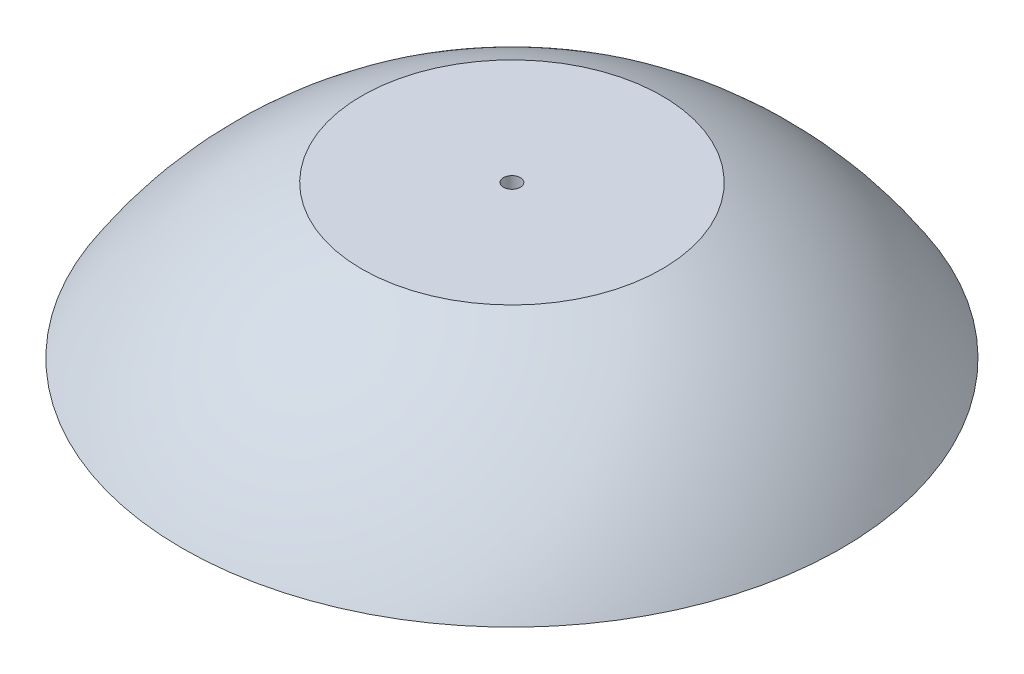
ISO-10303-21;
HEADER;
FILE_DESCRIPTION(('STEP AP214'),'2;1');
FILE_NAME('part.step','',(''),(''),'','','');
FILE_SCHEMA(('AUTOMOTIVE_DESIGN { 1 0 10303 214 1 1 1 1 }'));
ENDSEC;
DATA;
#1=APPLICATION_CONTEXT('core data for automotive mechanical design processes');
#2=APPLICATION_PROTOCOL_DEFINITION('international standard','automotive_design',2000,#1);
#3=PRODUCT_CONTEXT('',#1,'mechanical');
#4=PRODUCT('Part','Part','',(#3));
#5=PRODUCT_RELATED_PRODUCT_CATEGORY('part','',(#4));
#6=PRODUCT_DEFINITION_FORMATION('','',#4);
#7=PRODUCT_DEFINITION_CONTEXT('part definition',#1,'design');
#8=PRODUCT_DEFINITION('design','',#6,#7);
#9=PRODUCT_DEFINITION_SHAPE('','',#8);
#10=(LENGTH_UNIT() NAMED_UNIT(*) SI_UNIT(.MILLI.,.METRE.));
#11=(NAMED_UNIT(*) PLANE_ANGLE_UNIT() SI_UNIT($,.RADIAN.));
#12=(NAMED_UNIT(*) SI_UNIT($,.STERADIAN.) SOLID_ANGLE_UNIT());
#13=UNCERTAINTY_MEASURE_WITH_UNIT(LENGTH_MEASURE(1.E-05),#10,'distance_accuracy_value','');
#14=(GEOMETRIC_REPRESENTATION_CONTEXT(3) GLOBAL_UNCERTAINTY_ASSIGNED_CONTEXT((#13)) GLOBAL_UNIT_ASSIGNED_CONTEXT((#10,
#11,#12)) REPRESENTATION_CONTEXT('',''));
#15=CARTESIAN_POINT('',(0.,0.,0.));
#16=DIRECTION('',(0.,0.,1.));
#17=DIRECTION('',(1.,0.,0.));
#18=AXIS2_PLACEMENT_3D('',#15,#16,#17);
#19=CARTESIAN_POINT('',(0.,48.1851321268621,0.));
#20=DIRECTION('',(0.,1.,0.));
#21=DIRECTION('',(0.,0.,1.));
#22=AXIS2_PLACEMENT_3D('',#19,#20,#21);
#23=PLANE('',#22);
#24=CARTESIAN_POINT('',(0.,48.1851321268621,0.));
#25=DIRECTION('',(0.,-1.,0.));
#26=DIRECTION('',(0.,0.,-1.));
#27=AXIS2_PLACEMENT_3D('',#24,#25,#26);
#28=CIRCLE('',#27,36.5649959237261);
#29=CARTESIAN_POINT('',(0.,48.1851321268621,-36.5649959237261));
#30=VERTEX_POINT('',#29);
#31=EDGE_CURVE('E115',#30,#30,#28,.T.);
#32=ORIENTED_EDGE('',*,*,#31,.T.);
#33=EDGE_LOOP('',(#32));
#34=FACE_BOUND('',#33,.T.);
#35=CARTESIAN_POINT('',(0.,48.1851321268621,0.));
#36=DIRECTION('',(0.,1.,0.));
#37=DIRECTION('',(0.,0.,1.));
#38=AXIS2_PLACEMENT_3D('',#35,#36,#37);
#39=CIRCLE('',#38,31.75);
#40=CARTESIAN_POINT('',(0.,48.1851321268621,31.75));
#41=VERTEX_POINT('',#40);
#42=EDGE_CURVE('E10',#41,#41,#39,.F.);
#43=ORIENTED_EDGE('',*,*,#42,.F.);
#44=EDGE_LOOP('',(#43));
#45=FACE_BOUND('',#44,.T.);
#46=ADVANCED_FACE('F32',(#34,#45),#23,.F.);
#47=CARTESIAN_POINT('',(0.,8.49763212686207,0.));
#48=DIRECTION('',(0.,-1.,0.));
#49=DIRECTION('',(0.,0.,-1.));
#50=AXIS2_PLACEMENT_3D('',#47,#48,#49);
#51=TOROIDAL_SURFACE('',#50,89.0264613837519,1.5875);
#52=CARTESIAN_POINT('',(0.,10.0836229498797,0.));
#53=DIRECTION('',(0.,1.,0.));
#54=DIRECTION('',(0.,0.,1.));
#55=AXIS2_PLACEMENT_3D('',#52,#53,#54);
#56=CIRCLE('',#55,89.0956665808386);
#57=CARTESIAN_POINT('',(0.,10.0836229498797,89.0956665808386));
#58=VERTEX_POINT('',#57);
#59=EDGE_CURVE('E127',#58,#58,#56,.F.);
#60=ORIENTED_EDGE('',*,*,#59,.T.);
#61=EDGE_LOOP('',(#60));
#62=FACE_BOUND('',#61,.T.);
#63=CARTESIAN_POINT('',(0.,10.0851321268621,0.));
#64=DIRECTION('',(0.,-1.,0.));
#65=DIRECTION('',(0.,0.,-1.));
#66=AXIS2_PLACEMENT_3D('',#63,#64,#65);
#67=CIRCLE('',#66,89.0264613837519);
#68=CARTESIAN_POINT('',(0.,10.0851321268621,-89.0264613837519));
#69=VERTEX_POINT('',#68);
#70=EDGE_CURVE('E40',#69,#69,#67,.T.);
#71=ORIENTED_EDGE('',*,*,#70,.F.);
#72=EDGE_LOOP('',(#71));
#73=FACE_BOUND('',#72,.T.);
#74=ADVANCED_FACE('F156',(#62,#73),#51,.F.);
#75=CARTESIAN_POINT('',(0.,10.0851321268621,89.0264613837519));
#76=DIRECTION('',(0.,1.,0.));
#77=DIRECTION('',(0.,0.,1.));
#78=AXIS2_PLACEMENT_3D('',#75,#76,#77);
#79=PLANE('',#78);
#80=CARTESIAN_POINT('',(0.,10.0851321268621,0.));
#81=DIRECTION('',(0.,-1.,0.));
#82=DIRECTION('',(0.,0.,-1.));
#83=AXIS2_PLACEMENT_3D('',#80,#81,#82);
#84=CIRCLE('',#83,86.982540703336);
#85=CARTESIAN_POINT('',(0.,10.0851321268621,-86.982540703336));
#86=VERTEX_POINT('',#85);
#87=EDGE_CURVE('E44',#86,#86,#84,.T.);
#88=ORIENTED_EDGE('',*,*,#87,.F.);
#89=EDGE_LOOP('',(#88));
#90=FACE_BOUND('',#89,.T.);
#91=ORIENTED_EDGE('',*,*,#70,.T.);
#92=EDGE_LOOP('',(#91));
#93=FACE_BOUND('',#92,.T.);
#94=ADVANCED_FACE('F162',(#90,#93),#79,.F.);
#95=CARTESIAN_POINT('',(0.,11.6726321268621,0.));
#96=DIRECTION('',(0.,-1.,0.));
#97=DIRECTION('',(0.,0.,-1.));
#98=AXIS2_PLACEMENT_3D('',#95,#96,#97);
#99=TOROIDAL_SURFACE('',#98,86.982540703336,1.5875);
#100=CARTESIAN_POINT('',(0.,11.6726321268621,0.));
#101=DIRECTION('',(0.,-1.,0.));
#102=DIRECTION('',(0.,0.,-1.));
#103=AXIS2_PLACEMENT_3D('',#100,#101,#102);
#104=CIRCLE('',#103,85.395040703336);
#105=CARTESIAN_POINT('',(0.,11.6726321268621,-85.395040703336));
#106=VERTEX_POINT('',#105);
#107=EDGE_CURVE('E49',#106,#106,#104,.T.);
#108=ORIENTED_EDGE('',*,*,#107,.F.);
#109=EDGE_LOOP('',(#108));
#110=FACE_BOUND('',#109,.T.);
#111=ORIENTED_EDGE('',*,*,#87,.T.);
#112=EDGE_LOOP('',(#111));
#113=FACE_BOUND('',#112,.T.);
#114=ADVANCED_FACE('F254',(#110,#113),#99,.T.);
#115=CARTESIAN_POINT('',(0.,0.,0.));
#116=DIRECTION('',(0.,-1.,0.));
#117=DIRECTION('',(0.,0.,-1.));
#118=AXIS2_PLACEMENT_3D('',#115,#116,#117);
#119=CYLINDRICAL_SURFACE('',#118,85.395040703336);
#120=CARTESIAN_POINT('',(0.,14.8476321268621,0.));
#121=DIRECTION('',(0.,-1.,0.));
#122=DIRECTION('',(0.,0.,-1.));
#123=AXIS2_PLACEMENT_3D('',#120,#121,#122);
#124=CIRCLE('',#123,85.395040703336);
#125=CARTESIAN_POINT('',(0.,14.8476321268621,-85.395040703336));
#126=VERTEX_POINT('',#125);
#127=EDGE_CURVE('E52',#126,#126,#124,.T.);
#128=ORIENTED_EDGE('',*,*,#127,.F.);
#129=EDGE_LOOP('',(#128));
#130=FACE_BOUND('',#129,.T.);
#131=ORIENTED_EDGE('',*,*,#107,.T.);
#132=EDGE_LOOP('',(#131));
#133=FACE_BOUND('',#132,.T.);
#134=ADVANCED_FACE('F250',(#130,#133),#119,.F.);
#135=CARTESIAN_POINT('',(0.,14.8476321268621,0.));
#136=DIRECTION('',(0.,-1.,0.));
#137=DIRECTION('',(0.,0.,-1.));
#138=AXIS2_PLACEMENT_3D('',#135,#136,#137);
#139=TOROIDAL_SURFACE('',#138,83.807540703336,1.5875);
#140=CARTESIAN_POINT('',(0.,16.4351321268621,0.));
#141=DIRECTION('',(0.,-1.,0.));
#142=DIRECTION('',(0.,0.,-1.));
#143=AXIS2_PLACEMENT_3D('',#140,#141,#142);
#144=CIRCLE('',#143,83.807540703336);
#145=CARTESIAN_POINT('',(0.,16.4351321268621,-83.807540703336));
#146=VERTEX_POINT('',#145);
#147=EDGE_CURVE('E55',#146,#146,#144,.T.);
#148=ORIENTED_EDGE('',*,*,#147,.F.);
#149=EDGE_LOOP('',(#148));
#150=FACE_BOUND('',#149,.T.);
#151=ORIENTED_EDGE('',*,*,#127,.T.);
#152=EDGE_LOOP('',(#151));
#153=FACE_BOUND('',#152,.T.);
#154=ADVANCED_FACE('F246',(#150,#153),#139,.F.);
#155=CARTESIAN_POINT('',(0.,16.4351321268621,83.807540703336));
#156=DIRECTION('',(0.,1.,0.));
#157=DIRECTION('',(0.,0.,1.));
#158=AXIS2_PLACEMENT_3D('',#155,#156,#157);
#159=PLANE('',#158);
#160=CARTESIAN_POINT('',(0.,16.4351321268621,0.));
#161=DIRECTION('',(0.,-1.,0.));
#162=DIRECTION('',(0.,0.,-1.));
#163=AXIS2_PLACEMENT_3D('',#160,#161,#162);
#164=CIRCLE('',#163,80.9077960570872);
#165=CARTESIAN_POINT('',(0.,16.4351321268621,-80.9077960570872));
#166=VERTEX_POINT('',#165);
#167=EDGE_CURVE('E58',#166,#166,#164,.T.);
#168=ORIENTED_EDGE('',*,*,#167,.F.);
#169=EDGE_LOOP('',(#168));
#170=FACE_BOUND('',#169,.T.);
#171=ORIENTED_EDGE('',*,*,#147,.T.);
#172=EDGE_LOOP('',(#171));
#173=FACE_BOUND('',#172,.T.);
#174=ADVANCED_FACE('F242',(#170,#173),#159,.F.);
#175=CARTESIAN_POINT('',(0.,18.0226321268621,0.));
#176=DIRECTION('',(0.,-1.,0.));
#177=DIRECTION('',(0.,0.,-1.));
#178=AXIS2_PLACEMENT_3D('',#175,#176,#177);
#179=TOROIDAL_SURFACE('',#178,80.9077960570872,1.58750000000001);
#180=CARTESIAN_POINT('',(0.,18.0226321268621,0.));
#181=DIRECTION('',(0.,-1.,0.));
#182=DIRECTION('',(0.,0.,-1.));
#183=AXIS2_PLACEMENT_3D('',#180,#181,#182);
#184=CIRCLE('',#183,79.3202960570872);
#185=CARTESIAN_POINT('',(0.,18.0226321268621,-79.3202960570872));
#186=VERTEX_POINT('',#185);
#187=EDGE_CURVE('E61',#186,#186,#184,.T.);
#188=ORIENTED_EDGE('',*,*,#187,.F.);
#189=EDGE_LOOP('',(#188));
#190=FACE_BOUND('',#189,.T.);
#191=ORIENTED_EDGE('',*,*,#167,.T.);
#192=EDGE_LOOP('',(#191));
#193=FACE_BOUND('',#192,.T.);
#194=ADVANCED_FACE('F238',(#190,#193),#179,.T.);
#195=CARTESIAN_POINT('',(0.,0.,0.));
#196=DIRECTION('',(0.,-1.,0.));
#197=DIRECTION('',(0.,0.,-1.));
#198=AXIS2_PLACEMENT_3D('',#195,#196,#197);
#199=CYLINDRICAL_SURFACE('',#198,79.3202960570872);
#200=CARTESIAN_POINT('',(0.,21.1976321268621,0.));
#201=DIRECTION('',(0.,-1.,0.));
#202=DIRECTION('',(0.,0.,-1.));
#203=AXIS2_PLACEMENT_3D('',#200,#201,#202);
#204=CIRCLE('',#203,79.3202960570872);
#205=CARTESIAN_POINT('',(0.,21.1976321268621,-79.3202960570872));
#206=VERTEX_POINT('',#205);
#207=EDGE_CURVE('E64',#206,#206,#204,.T.);
#208=ORIENTED_EDGE('',*,*,#207,.F.);
#209=EDGE_LOOP('',(#208));
#210=FACE_BOUND('',#209,.T.);
#211=ORIENTED_EDGE('',*,*,#187,.T.);
#212=EDGE_LOOP('',(#211));
#213=FACE_BOUND('',#212,.T.);
#214=ADVANCED_FACE('F234',(#210,#213),#199,.F.);
#215=CARTESIAN_POINT('',(0.,21.1976321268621,0.));
#216=DIRECTION('',(0.,-1.,0.));
#217=DIRECTION('',(0.,0.,-1.));
#218=AXIS2_PLACEMENT_3D('',#215,#216,#217);
#219=TOROIDAL_SURFACE('',#218,77.7327960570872,1.5875);
#220=CARTESIAN_POINT('',(0.,22.7851321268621,0.));
#221=DIRECTION('',(0.,-1.,0.));
#222=DIRECTION('',(0.,0.,-1.));
#223=AXIS2_PLACEMENT_3D('',#220,#221,#222);
#224=CIRCLE('',#223,77.7327960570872);
#225=CARTESIAN_POINT('',(0.,22.7851321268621,-77.7327960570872));
#226=VERTEX_POINT('',#225);
#227=EDGE_CURVE('E67',#226,#226,#224,.T.);
#228=ORIENTED_EDGE('',*,*,#227,.F.);
#229=EDGE_LOOP('',(#228));
#230=FACE_BOUND('',#229,.T.);
#231=ORIENTED_EDGE('',*,*,#207,.T.);
#232=EDGE_LOOP('',(#231));
#233=FACE_BOUND('',#232,.T.);
#234=ADVANCED_FACE('F230',(#230,#233),#219,.F.);
#235=CARTESIAN_POINT('',(0.,22.7851321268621,77.7327960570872));
#236=DIRECTION('',(0.,1.,0.));
#237=DIRECTION('',(0.,0.,1.));
#238=AXIS2_PLACEMENT_3D('',#235,#236,#237);
#239=PLANE('',#238);
#240=CARTESIAN_POINT('',(0.,22.7851321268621,0.));
#241=DIRECTION('',(0.,-1.,0.));
#242=DIRECTION('',(0.,0.,-1.));
#243=AXIS2_PLACEMENT_3D('',#240,#241,#242);
#244=CIRCLE('',#243,73.7590102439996);
#245=CARTESIAN_POINT('',(0.,22.7851321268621,-73.7590102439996));
#246=VERTEX_POINT('',#245);
#247=EDGE_CURVE('E70',#246,#246,#244,.T.);
#248=ORIENTED_EDGE('',*,*,#247,.F.);
#249=EDGE_LOOP('',(#248));
#250=FACE_BOUND('',#249,.T.);
#251=ORIENTED_EDGE('',*,*,#227,.T.);
#252=EDGE_LOOP('',(#251));
#253=FACE_BOUND('',#252,.T.);
#254=ADVANCED_FACE('F226',(#250,#253),#239,.F.);
#255=CARTESIAN_POINT('',(0.,24.3726321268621,0.));
#256=DIRECTION('',(0.,-1.,0.));
#257=DIRECTION('',(0.,0.,-1.));
#258=AXIS2_PLACEMENT_3D('',#255,#256,#257);
#259=TOROIDAL_SURFACE('',#258,73.7590102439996,1.5875);
#260=CARTESIAN_POINT('',(0.,24.3726321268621,0.));
#261=DIRECTION('',(0.,-1.,0.));
#262=DIRECTION('',(0.,0.,-1.));
#263=AXIS2_PLACEMENT_3D('',#260,#261,#262);
#264=CIRCLE('',#263,72.1715102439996);
#265=CARTESIAN_POINT('',(0.,24.3726321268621,-72.1715102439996));
#266=VERTEX_POINT('',#265);
#267=EDGE_CURVE('E73',#266,#266,#264,.T.);
#268=ORIENTED_EDGE('',*,*,#267,.F.);
#269=EDGE_LOOP('',(#268));
#270=FACE_BOUND('',#269,.T.);
#271=ORIENTED_EDGE('',*,*,#247,.T.);
#272=EDGE_LOOP('',(#271));
#273=FACE_BOUND('',#272,.T.);
#274=ADVANCED_FACE('F222',(#270,#273),#259,.T.);
#275=CARTESIAN_POINT('',(0.,0.,0.));
#276=DIRECTION('',(0.,-1.,0.));
#277=DIRECTION('',(0.,0.,-1.));
#278=AXIS2_PLACEMENT_3D('',#275,#276,#277);
#279=CYLINDRICAL_SURFACE('',#278,72.1715102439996);
#280=CARTESIAN_POINT('',(0.,27.5476321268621,0.));
#281=DIRECTION('',(0.,-1.,0.));
#282=DIRECTION('',(0.,0.,-1.));
#283=AXIS2_PLACEMENT_3D('',#280,#281,#282);
#284=CIRCLE('',#283,72.1715102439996);
#285=CARTESIAN_POINT('',(0.,27.5476321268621,-72.1715102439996));
#286=VERTEX_POINT('',#285);
#287=EDGE_CURVE('E76',#286,#286,#284,.T.);
#288=ORIENTED_EDGE('',*,*,#287,.F.);
#289=EDGE_LOOP('',(#288));
#290=FACE_BOUND('',#289,.T.);
#291=ORIENTED_EDGE('',*,*,#267,.T.);
#292=EDGE_LOOP('',(#291));
#293=FACE_BOUND('',#292,.T.);
#294=ADVANCED_FACE('F218',(#290,#293),#279,.F.);
#295=CARTESIAN_POINT('',(0.,27.5476321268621,0.));
#296=DIRECTION('',(0.,-1.,0.));
#297=DIRECTION('',(0.,0.,-1.));
#298=AXIS2_PLACEMENT_3D('',#295,#296,#297);
#299=TOROIDAL_SURFACE('',#298,70.5840102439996,1.5875);
#300=CARTESIAN_POINT('',(0.,29.1351321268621,0.));
#301=DIRECTION('',(0.,-1.,0.));
#302=DIRECTION('',(0.,0.,-1.));
#303=AXIS2_PLACEMENT_3D('',#300,#301,#302);
#304=CIRCLE('',#303,70.5840102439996);
#305=CARTESIAN_POINT('',(0.,29.1351321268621,-70.5840102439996));
#306=VERTEX_POINT('',#305);
#307=EDGE_CURVE('E79',#306,#306,#304,.T.);
#308=ORIENTED_EDGE('',*,*,#307,.F.);
#309=EDGE_LOOP('',(#308));
#310=FACE_BOUND('',#309,.T.);
#311=ORIENTED_EDGE('',*,*,#287,.T.);
#312=EDGE_LOOP('',(#311));
#313=FACE_BOUND('',#312,.T.);
#314=ADVANCED_FACE('F214',(#310,#313),#299,.F.);
#315=CARTESIAN_POINT('',(0.,29.1351321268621,70.5840102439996));
#316=DIRECTION('',(0.,1.,0.));
#317=DIRECTION('',(0.,0.,1.));
#318=AXIS2_PLACEMENT_3D('',#315,#316,#317);
#319=PLANE('',#318);
#320=CARTESIAN_POINT('',(0.,29.1351321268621,0.));
#321=DIRECTION('',(0.,-1.,0.));
#322=DIRECTION('',(0.,0.,-1.));
#323=AXIS2_PLACEMENT_3D('',#320,#321,#322);
#324=CIRCLE('',#323,65.1703193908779);
#325=CARTESIAN_POINT('',(0.,29.1351321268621,-65.1703193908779));
#326=VERTEX_POINT('',#325);
#327=EDGE_CURVE('E82',#326,#326,#324,.T.);
#328=ORIENTED_EDGE('',*,*,#327,.F.);
#329=EDGE_LOOP('',(#328));
#330=FACE_BOUND('',#329,.T.);
#331=ORIENTED_EDGE('',*,*,#307,.T.);
#332=EDGE_LOOP('',(#331));
#333=FACE_BOUND('',#332,.T.);
#334=ADVANCED_FACE('F210',(#330,#333),#319,.F.);
#335=CARTESIAN_POINT('',(0.,30.7226321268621,0.));
#336=DIRECTION('',(0.,-1.,0.));
#337=DIRECTION('',(0.,0.,-1.));
#338=AXIS2_PLACEMENT_3D('',#335,#336,#337);
#339=TOROIDAL_SURFACE('',#338,65.1703193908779,1.5875);
#340=CARTESIAN_POINT('',(0.,30.7226321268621,0.));
#341=DIRECTION('',(0.,-1.,0.));
#342=DIRECTION('',(0.,0.,-1.));
#343=AXIS2_PLACEMENT_3D('',#340,#341,#342);
#344=CIRCLE('',#343,63.5828193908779);
#345=CARTESIAN_POINT('',(0.,30.7226321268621,-63.5828193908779));
#346=VERTEX_POINT('',#345);
#347=EDGE_CURVE('E85',#346,#346,#344,.T.);
#348=ORIENTED_EDGE('',*,*,#347,.F.);
#349=EDGE_LOOP('',(#348));
#350=FACE_BOUND('',#349,.T.);
#351=ORIENTED_EDGE('',*,*,#327,.T.);
#352=EDGE_LOOP('',(#351));
#353=FACE_BOUND('',#352,.T.);
#354=ADVANCED_FACE('F206',(#350,#353),#339,.T.);
#355=CARTESIAN_POINT('',(0.,0.,0.));
#356=DIRECTION('',(0.,-1.,0.));
#357=DIRECTION('',(0.,0.,-1.));
#358=AXIS2_PLACEMENT_3D('',#355,#356,#357);
#359=CYLINDRICAL_SURFACE('',#358,63.5828193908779);
#360=CARTESIAN_POINT('',(0.,33.8976321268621,0.));
#361=DIRECTION('',(0.,-1.,0.));
#362=DIRECTION('',(0.,0.,-1.));
#363=AXIS2_PLACEMENT_3D('',#360,#361,#362);
#364=CIRCLE('',#363,63.5828193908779);
#365=CARTESIAN_POINT('',(0.,33.8976321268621,-63.5828193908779));
#366=VERTEX_POINT('',#365);
#367=EDGE_CURVE('E88',#366,#366,#364,.T.);
#368=ORIENTED_EDGE('',*,*,#367,.F.);
#369=EDGE_LOOP('',(#368));
#370=FACE_BOUND('',#369,.T.);
#371=ORIENTED_EDGE('',*,*,#347,.T.);
#372=EDGE_LOOP('',(#371));
#373=FACE_BOUND('',#372,.T.);
#374=ADVANCED_FACE('F202',(#370,#373),#359,.F.);
#375=CARTESIAN_POINT('',(0.,33.8976321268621,0.));
#376=DIRECTION('',(0.,-1.,0.));
#377=DIRECTION('',(0.,0.,-1.));
#378=AXIS2_PLACEMENT_3D('',#375,#376,#377);
#379=TOROIDAL_SURFACE('',#378,61.9953193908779,1.58750000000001);
#380=CARTESIAN_POINT('',(0.,35.4851321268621,0.));
#381=DIRECTION('',(0.,-1.,0.));
#382=DIRECTION('',(0.,0.,-1.));
#383=AXIS2_PLACEMENT_3D('',#380,#381,#382);
#384=CIRCLE('',#383,61.9953193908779);
#385=CARTESIAN_POINT('',(0.,35.4851321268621,-61.9953193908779));
#386=VERTEX_POINT('',#385);
#387=EDGE_CURVE('E91',#386,#386,#384,.T.);
#388=ORIENTED_EDGE('',*,*,#387,.F.);
#389=EDGE_LOOP('',(#388));
#390=FACE_BOUND('',#389,.T.);
#391=ORIENTED_EDGE('',*,*,#367,.T.);
#392=EDGE_LOOP('',(#391));
#393=FACE_BOUND('',#392,.T.);
#394=ADVANCED_FACE('F198',(#390,#393),#379,.F.);
#395=CARTESIAN_POINT('',(0.,35.4851321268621,61.9953193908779));
#396=DIRECTION('',(0.,1.,0.));
#397=DIRECTION('',(0.,0.,1.));
#398=AXIS2_PLACEMENT_3D('',#395,#396,#397);
#399=PLANE('',#398);
#400=CARTESIAN_POINT('',(0.,35.4851321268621,0.));
#401=DIRECTION('',(0.,-1.,0.));
#402=DIRECTION('',(0.,0.,-1.));
#403=AXIS2_PLACEMENT_3D('',#400,#401,#402);
#404=CIRCLE('',#403,54.4336002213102);
#405=CARTESIAN_POINT('',(0.,35.4851321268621,-54.4336002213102));
#406=VERTEX_POINT('',#405);
#407=EDGE_CURVE('E94',#406,#406,#404,.T.);
#408=ORIENTED_EDGE('',*,*,#407,.F.);
#409=EDGE_LOOP('',(#408));
#410=FACE_BOUND('',#409,.T.);
#411=ORIENTED_EDGE('',*,*,#387,.T.);
#412=EDGE_LOOP('',(#411));
#413=FACE_BOUND('',#412,.T.);
#414=ADVANCED_FACE('F194',(#410,#413),#399,.F.);
#415=CARTESIAN_POINT('',(0.,37.0726321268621,0.));
#416=DIRECTION('',(0.,-1.,0.));
#417=DIRECTION('',(0.,0.,-1.));
#418=AXIS2_PLACEMENT_3D('',#415,#416,#417);
#419=TOROIDAL_SURFACE('',#418,54.4336002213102,1.5875);
#420=CARTESIAN_POINT('',(0.,37.0726321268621,0.));
#421=DIRECTION('',(0.,-1.,0.));
#422=DIRECTION('',(0.,0.,-1.));
#423=AXIS2_PLACEMENT_3D('',#420,#421,#422);
#424=CIRCLE('',#423,52.8461002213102);
#425=CARTESIAN_POINT('',(0.,37.0726321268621,-52.8461002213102));
#426=VERTEX_POINT('',#425);
#427=EDGE_CURVE('E97',#426,#426,#424,.T.);
#428=ORIENTED_EDGE('',*,*,#427,.F.);
#429=EDGE_LOOP('',(#428));
#430=FACE_BOUND('',#429,.T.);
#431=ORIENTED_EDGE('',*,*,#407,.T.);
#432=EDGE_LOOP('',(#431));
#433=FACE_BOUND('',#432,.T.);
#434=ADVANCED_FACE('F190',(#430,#433),#419,.T.);
#435=CARTESIAN_POINT('',(0.,0.,0.));
#436=DIRECTION('',(0.,-1.,0.));
#437=DIRECTION('',(0.,0.,-1.));
#438=AXIS2_PLACEMENT_3D('',#435,#436,#437);
#439=CYLINDRICAL_SURFACE('',#438,52.8461002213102);
#440=CARTESIAN_POINT('',(0.,40.2476321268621,0.));
#441=DIRECTION('',(0.,-1.,0.));
#442=DIRECTION('',(0.,0.,-1.));
#443=AXIS2_PLACEMENT_3D('',#440,#441,#442);
#444=CIRCLE('',#443,52.8461002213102);
#445=CARTESIAN_POINT('',(0.,40.2476321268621,-52.8461002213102));
#446=VERTEX_POINT('',#445);
#447=EDGE_CURVE('E100',#446,#446,#444,.T.);
#448=ORIENTED_EDGE('',*,*,#447,.F.);
#449=EDGE_LOOP('',(#448));
#450=FACE_BOUND('',#449,.T.);
#451=ORIENTED_EDGE('',*,*,#427,.T.);
#452=EDGE_LOOP('',(#451));
#453=FACE_BOUND('',#452,.T.);
#454=ADVANCED_FACE('F186',(#450,#453),#439,.F.);
#455=CARTESIAN_POINT('',(0.,40.2476321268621,0.));
#456=DIRECTION('',(0.,-1.,0.));
#457=DIRECTION('',(0.,0.,-1.));
#458=AXIS2_PLACEMENT_3D('',#455,#456,#457);
#459=TOROIDAL_SURFACE('',#458,51.2586002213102,1.5875);
#460=CARTESIAN_POINT('',(0.,41.8351321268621,0.));
#461=DIRECTION('',(0.,-1.,0.));
#462=DIRECTION('',(0.,0.,-1.));
#463=AXIS2_PLACEMENT_3D('',#460,#461,#462);
#464=CIRCLE('',#463,51.2586002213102);
#465=CARTESIAN_POINT('',(0.,41.8351321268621,-51.2586002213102));
#466=VERTEX_POINT('',#465);
#467=EDGE_CURVE('E103',#466,#466,#464,.T.);
#468=ORIENTED_EDGE('',*,*,#467,.F.);
#469=EDGE_LOOP('',(#468));
#470=FACE_BOUND('',#469,.T.);
#471=ORIENTED_EDGE('',*,*,#447,.T.);
#472=EDGE_LOOP('',(#471));
#473=FACE_BOUND('',#472,.T.);
#474=ADVANCED_FACE('F182',(#470,#473),#459,.F.);
#475=CARTESIAN_POINT('',(0.,41.8351321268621,39.7399959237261));
#476=DIRECTION('',(0.,1.,0.));
#477=DIRECTION('',(0.,0.,1.));
#478=AXIS2_PLACEMENT_3D('',#475,#476,#477);
#479=PLANE('',#478);
#480=CARTESIAN_POINT('',(0.,41.8351321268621,0.));
#481=DIRECTION('',(0.,-1.,0.));
#482=DIRECTION('',(0.,0.,-1.));
#483=AXIS2_PLACEMENT_3D('',#480,#481,#482);
#484=CIRCLE('',#483,39.7399959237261);
#485=CARTESIAN_POINT('',(0.,41.8351321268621,-39.7399959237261));
#486=VERTEX_POINT('',#485);
#487=EDGE_CURVE('E106',#486,#486,#484,.T.);
#488=ORIENTED_EDGE('',*,*,#487,.F.);
#489=EDGE_LOOP('',(#488));
#490=FACE_BOUND('',#489,.T.);
#491=ORIENTED_EDGE('',*,*,#467,.T.);
#492=EDGE_LOOP('',(#491));
#493=FACE_BOUND('',#492,.T.);
#494=ADVANCED_FACE('F178',(#490,#493),#479,.F.);
#495=CARTESIAN_POINT('',(0.,43.4226321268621,0.));
#496=DIRECTION('',(0.,-1.,0.));
#497=DIRECTION('',(0.,0.,-1.));
#498=AXIS2_PLACEMENT_3D('',#495,#496,#497);
#499=TOROIDAL_SURFACE('',#498,39.7399959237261,1.5875);
#500=CARTESIAN_POINT('',(0.,43.4226321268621,0.));
#501=DIRECTION('',(0.,-1.,0.));
#502=DIRECTION('',(0.,0.,-1.));
#503=AXIS2_PLACEMENT_3D('',#500,#501,#502);
#504=CIRCLE('',#503,38.1524959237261);
#505=CARTESIAN_POINT('',(0.,43.4226321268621,-38.1524959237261));
#506=VERTEX_POINT('',#505);
#507=EDGE_CURVE('E109',#506,#506,#504,.T.);
#508=ORIENTED_EDGE('',*,*,#507,.F.);
#509=EDGE_LOOP('',(#508));
#510=FACE_BOUND('',#509,.T.);
#511=ORIENTED_EDGE('',*,*,#487,.T.);
#512=EDGE_LOOP('',(#511));
#513=FACE_BOUND('',#512,.T.);
#514=ADVANCED_FACE('F174',(#510,#513),#499,.T.);
#515=CARTESIAN_POINT('',(0.,0.,0.));
#516=DIRECTION('',(0.,-1.,0.));
#517=DIRECTION('',(0.,0.,-1.));
#518=AXIS2_PLACEMENT_3D('',#515,#516,#517);
#519=CYLINDRICAL_SURFACE('',#518,38.1524959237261);
#520=CARTESIAN_POINT('',(0.,46.5976321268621,0.));
#521=DIRECTION('',(0.,-1.,0.));
#522=DIRECTION('',(0.,0.,-1.));
#523=AXIS2_PLACEMENT_3D('',#520,#521,#522);
#524=CIRCLE('',#523,38.1524959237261);
#525=CARTESIAN_POINT('',(0.,46.5976321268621,-38.1524959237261));
#526=VERTEX_POINT('',#525);
#527=EDGE_CURVE('E112',#526,#526,#524,.T.);
#528=ORIENTED_EDGE('',*,*,#527,.F.);
#529=EDGE_LOOP('',(#528));
#530=FACE_BOUND('',#529,.T.);
#531=ORIENTED_EDGE('',*,*,#507,.T.);
#532=EDGE_LOOP('',(#531));
#533=FACE_BOUND('',#532,.T.);
#534=ADVANCED_FACE('F170',(#530,#533),#519,.F.);
#535=CARTESIAN_POINT('',(0.,46.5976321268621,0.));
#536=DIRECTION('',(0.,-1.,0.));
#537=DIRECTION('',(0.,0.,-1.));
#538=AXIS2_PLACEMENT_3D('',#535,#536,#537);
#539=TOROIDAL_SURFACE('',#538,36.5649959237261,1.5875);
#540=ORIENTED_EDGE('',*,*,#31,.F.);
#541=EDGE_LOOP('',(#540));
#542=FACE_BOUND('',#541,.T.);
#543=ORIENTED_EDGE('',*,*,#527,.T.);
#544=EDGE_LOOP('',(#543));
#545=FACE_BOUND('',#544,.T.);
#546=ADVANCED_FACE('F150',(#542,#545),#539,.F.);
#547=CARTESIAN_POINT('',(0.,-91.3921100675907,0.));
#548=DIRECTION('',(0.,1.,0.));
#549=DIRECTION('',(0.,0.,1.));
#550=AXIS2_PLACEMENT_3D('',#547,#548,#549);
#551=CYLINDRICAL_SURFACE('',#550,31.75);
#552=CARTESIAN_POINT('',(0.,10.0836229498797,0.));
#553=DIRECTION('',(0.,1.,0.));
#554=DIRECTION('',(0.,0.,1.));
#555=AXIS2_PLACEMENT_3D('',#552,#553,#554);
#556=CIRCLE('',#555,31.75);
#557=CARTESIAN_POINT('',(0.,10.0836229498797,31.75));
#558=VERTEX_POINT('',#557);
#559=EDGE_CURVE('E36',#558,#558,#556,.T.);
#560=ORIENTED_EDGE('',*,*,#559,.T.);
#561=EDGE_LOOP('',(#560));
#562=FACE_BOUND('',#561,.T.);
#563=ORIENTED_EDGE('',*,*,#42,.T.);
#564=EDGE_LOOP('',(#563));
#565=FACE_BOUND('',#564,.T.);
#566=ADVANCED_FACE('F137',(#562,#565),#551,.T.);
#567=CARTESIAN_POINT('',(-130.02492471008,10.0836229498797,-103.89713627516));
#568=DIRECTION('',(0.,1.,0.));
#569=DIRECTION('',(0.,0.,1.));
#570=AXIS2_PLACEMENT_3D('',#567,#568,#569);
#571=PLANE('',#570);
#572=ORIENTED_EDGE('',*,*,#559,.F.);
#573=EDGE_LOOP('',(#572));
#574=FACE_BOUND('',#573,.T.);
#575=CARTESIAN_POINT('',(0.,10.0836229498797,0.));
#576=DIRECTION('',(0.,1.,0.));
#577=DIRECTION('',(0.,0.,1.));
#578=AXIS2_PLACEMENT_3D('',#575,#576,#577);
#579=CIRCLE('',#578,2.4892);
#580=CARTESIAN_POINT('',(0.,10.0836229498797,2.4892));
#581=VERTEX_POINT('',#580);
#582=EDGE_CURVE('E130',#581,#581,#579,.F.);
#583=ORIENTED_EDGE('',*,*,#582,.F.);
#584=EDGE_LOOP('',(#583));
#585=FACE_BOUND('',#584,.T.);
#586=ADVANCED_FACE('F139',(#574,#585),#571,.F.);
#587=CARTESIAN_POINT('',(0.,-51.1067818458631,0.));
#588=DIRECTION('',(0.,-1.,0.));
#589=DIRECTION('',(0.,0.,1.));
#590=AXIS2_PLACEMENT_3D('',#587,#588,#589);
#591=SPHERICAL_SURFACE('',#590,115.09375);
#592=CARTESIAN_POINT('',(0.,10.0836229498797,0.));
#593=DIRECTION('',(0.,1.,0.));
#594=DIRECTION('',(0.,0.,1.));
#595=AXIS2_PLACEMENT_3D('',#592,#593,#594);
#596=CIRCLE('',#595,97.4797704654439);
#597=CARTESIAN_POINT('',(0.,10.0836229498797,97.4797704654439));
#598=VERTEX_POINT('',#597);
#599=EDGE_CURVE('E124',#598,#598,#596,.T.);
#600=CARTESIAN_POINT('',(0.,55.0788683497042,0.));
#601=DIRECTION('',(0.,-1.,0.));
#602=DIRECTION('',(0.,0.,-1.));
#603=AXIS2_PLACEMENT_3D('',#600,#601,#602);
#604=CIRCLE('',#603,44.3979614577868);
#605=CARTESIAN_POINT('',(0.,55.0788683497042,44.3979614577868));
#606=VERTEX_POINT('',#605);
#607=EDGE_CURVE('E118',#606,#606,#604,.T.);
#608=CARTESIAN_POINT('',(0.,10.0836229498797,97.4797704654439));
#609=CARTESIAN_POINT('',(0.,10.7073058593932,97.0882707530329));
#610=CARTESIAN_POINT('',(0.,11.3272304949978,96.690783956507));
#611=CARTESIAN_POINT('',(0.,12.5593370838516,95.8839860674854));
#612=CARTESIAN_POINT('',(0.,13.1715190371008,95.4746749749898));
#613=CARTESIAN_POINT('',(0.,14.3879141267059,94.6443783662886));
#614=CARTESIAN_POINT('',(0.,14.9921272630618,94.2233928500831));
#615=CARTESIAN_POINT('',(0.,16.1923622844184,93.3699027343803));
#616=CARTESIAN_POINT('',(0.,16.788384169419,92.937398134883));
#617=CARTESIAN_POINT('',(0.,17.9720170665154,92.0610291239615));
#618=CARTESIAN_POINT('',(0.,18.559628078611,91.6171647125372));
#619=CARTESIAN_POINT('',(0.,19.7262227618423,90.7182396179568));
#620=CARTESIAN_POINT('',(0.,20.3052064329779,90.2631789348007));
#621=CARTESIAN_POINT('',(0.,21.4543331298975,89.3420289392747));
#622=CARTESIAN_POINT('',(0.,22.0244761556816,88.8759396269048));
#623=CARTESIAN_POINT('',(0.,23.1557115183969,87.9329040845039));
#624=CARTESIAN_POINT('',(0.,23.7168038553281,87.4559578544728));
#625=CARTESIAN_POINT('',(0.,24.8297311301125,86.4913841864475));
#626=CARTESIAN_POINT('',(0.,25.3815660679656,86.0037567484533));
#627=CARTESIAN_POINT('',(0.,26.4757752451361,85.0180003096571));
#628=CARTESIAN_POINT('',(0.,27.0181494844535,84.5198713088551));
#629=CARTESIAN_POINT('',(0.,28.093237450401,83.5132952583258));
#630=CARTESIAN_POINT('',(0.,28.6259511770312,83.0048482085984));
#631=CARTESIAN_POINT('',(0.,29.6815218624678,81.9778233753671));
#632=CARTESIAN_POINT('',(0.,30.2043788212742,81.4592455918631));
#633=CARTESIAN_POINT('',(0.,31.2400433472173,80.4121503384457));
#634=CARTESIAN_POINT('',(0.,31.752850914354,79.8836328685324));
#635=CARTESIAN_POINT('',(0.,32.7682277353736,78.8168529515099));
#636=CARTESIAN_POINT('',(0.,33.2707969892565,78.2785905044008));
#637=CARTESIAN_POINT('',(0.,34.2655120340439,77.1925189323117));
#638=CARTESIAN_POINT('',(0.,34.7576578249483,76.6447098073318));
#639=CARTESIAN_POINT('',(0.,35.7313446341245,75.539746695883));
#640=CARTESIAN_POINT('',(0.,36.2128856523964,74.9825927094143));
#641=CARTESIAN_POINT('',(0.,37.1651855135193,73.8591451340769));
#642=CARTESIAN_POINT('',(0.,37.6359443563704,73.2928515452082));
#643=CARTESIAN_POINT('',(0.,38.566506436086,72.1513333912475));
#644=CARTESIAN_POINT('',(0.,39.0263096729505,71.5761088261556));
#645=CARTESIAN_POINT('',(0.,39.9347911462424,70.4169406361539));
#646=CARTESIAN_POINT('',(0.,40.3834693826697,69.8329970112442));
#647=CARTESIAN_POINT('',(0.,41.2695355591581,68.6566058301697));
#648=CARTESIAN_POINT('',(0.,41.706923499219,68.064158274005));
#649=CARTESIAN_POINT('',(0.,42.5702479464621,66.8709774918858));
#650=CARTESIAN_POINT('',(0.,42.9961844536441,66.2702442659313));
#651=CARTESIAN_POINT('',(0.,43.8364491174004,65.0607134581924));
#652=CARTESIAN_POINT('',(0.,44.2507772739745,64.451915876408));
#653=CARTESIAN_POINT('',(0.,45.0676725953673,63.2264806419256));
#654=CARTESIAN_POINT('',(0.,45.470239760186,62.6098429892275));
#655=CARTESIAN_POINT('',(0.,46.2634647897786,61.368954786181));
#656=CARTESIAN_POINT('',(0.,46.6541226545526,60.7447042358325));
#657=CARTESIAN_POINT('',(0.,47.4233851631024,59.4888202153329));
#658=CARTESIAN_POINT('',(0.,47.8019898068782,58.8571867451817));
#659=CARTESIAN_POINT('',(0.,48.5470063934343,57.5867695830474));
#660=CARTESIAN_POINT('',(0.,48.9134183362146,56.9479858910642));
#661=CARTESIAN_POINT('',(0.,49.6339145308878,55.6635036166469));
#662=CARTESIAN_POINT('',(0.,49.9879987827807,55.0178050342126));
#663=CARTESIAN_POINT('',(0.,50.6837091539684,53.7197308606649));
#664=CARTESIAN_POINT('',(0.,51.0253352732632,53.0673552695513));
#665=CARTESIAN_POINT('',(0.,51.6960035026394,51.7561674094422));
#666=CARTESIAN_POINT('',(0.,52.0250456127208,51.0973551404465));
#667=CARTESIAN_POINT('',(0.,52.6704246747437,49.7735366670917));
#668=CARTESIAN_POINT('',(0.,52.9867616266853,49.1085304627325));
#669=CARTESIAN_POINT('',(0.,53.6066135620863,47.7725689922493));
#670=CARTESIAN_POINT('',(0.,53.9101285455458,47.1016137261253));
#671=CARTESIAN_POINT('',(0.,54.5042257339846,45.754001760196));
#672=CARTESIAN_POINT('',(0.,54.794807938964,45.0773450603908));
#673=CARTESIAN_POINT('',(0.,55.0788683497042,44.3979614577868));
#674=B_SPLINE_CURVE_WITH_KNOTS('',3,(#608,#609,#610,#611,#612,#613,#614,#615,#616,#617,#618,
#619,#620,#621,#622,#623,#624,#625,#626,#627,#628,#629,#630,#631,#632,#633,#634,#635,#636,#637,
#638,#639,#640,#641,#642,#643,#644,#645,#646,#647,#648,#649,#650,#651,#652,#653,#654,#655,#656,
#657,#658,#659,#660,#661,#662,#663,#664,#665,#666,#667,#668,#669,#670,#671,#672,#673),
.UNSPECIFIED.,.F.,.F.,(4,2,2,2,2,2,2,2,2,2,2,2,2,2,2,2,2,2,2,2,2,2,2,2,2,2,2,2,2,2,2,2,4),(0.,
2.20909970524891,4.41819941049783,6.62729911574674,8.83639882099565,11.0454985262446,
13.2545982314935,15.4636979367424,17.6727976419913,19.8818973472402,22.0909970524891,
24.3000967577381,26.5091964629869,28.7182961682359,30.9273958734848,33.1364955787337,
35.3455952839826,37.5546949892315,39.7637946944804,41.9728943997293,44.1819941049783,
46.3910938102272,48.6001935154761,50.809293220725,53.0183929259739,55.2274926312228,
57.4365923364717,59.6456920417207,61.8547917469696,64.0638914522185,66.2729911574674,
68.4820908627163,70.6911905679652),.UNSPECIFIED.);
#675=EDGE_CURVE('BSEAM34',#598,#606,#674,.T.);
#676=ORIENTED_EDGE('',*,*,#599,.T.);
#677=ORIENTED_EDGE('',*,*,#607,.T.);
#678=ORIENTED_EDGE('',*,*,#675,.T.);
#679=ORIENTED_EDGE('',*,*,#675,.F.);
#680=EDGE_LOOP('',(#676,#678,#677,#679));
#681=FACE_BOUND('',#680,.T.);
#682=ADVANCED_FACE('F34',(#681),#591,.T.);
#683=CARTESIAN_POINT('',(0.,55.0788683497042,0.));
#684=DIRECTION('',(0.,-1.,0.));
#685=DIRECTION('',(0.,0.,-1.));
#686=AXIS2_PLACEMENT_3D('',#683,#684,#685);
#687=PLANE('',#686);
#688=CARTESIAN_POINT('',(0.,55.0788683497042,0.));
#689=DIRECTION('',(0.,-1.,0.));
#690=DIRECTION('',(0.,0.,-1.));
#691=AXIS2_PLACEMENT_3D('',#688,#689,#690);
#692=CIRCLE('',#691,2.4892);
#693=CARTESIAN_POINT('',(0.,55.0788683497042,-2.48919999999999));
#694=VERTEX_POINT('',#693);
#695=EDGE_CURVE('E121',#694,#694,#692,.T.);
#696=ORIENTED_EDGE('',*,*,#695,.T.);
#697=EDGE_LOOP('',(#696));
#698=FACE_BOUND('',#697,.T.);
#699=ORIENTED_EDGE('',*,*,#607,.F.);
#700=EDGE_LOOP('',(#699));
#701=FACE_BOUND('',#700,.T.);
#702=ADVANCED_FACE('F148',(#698,#701),#687,.F.);
#703=CARTESIAN_POINT('',(0.,55.0788683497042,0.));
#704=DIRECTION('',(0.,-1.,0.));
#705=DIRECTION('',(0.,0.,-1.));
#706=AXIS2_PLACEMENT_3D('',#703,#704,#705);
#707=CYLINDRICAL_SURFACE('',#706,2.4892);
#708=ORIENTED_EDGE('',*,*,#582,.T.);
#709=EDGE_LOOP('',(#708));
#710=FACE_BOUND('',#709,.T.);
#711=ORIENTED_EDGE('',*,*,#695,.F.);
#712=EDGE_LOOP('',(#711));
#713=FACE_BOUND('',#712,.T.);
#714=ADVANCED_FACE('F153',(#710,#713),#707,.F.);
#715=ORIENTED_EDGE('',*,*,#59,.F.);
#716=EDGE_LOOP('',(#715));
#717=FACE_BOUND('',#716,.T.);
#718=ORIENTED_EDGE('',*,*,#599,.F.);
#719=EDGE_LOOP('',(#718));
#720=FACE_BOUND('',#719,.T.);
#721=ADVANCED_FACE('F143',(#717,#720),#571,.F.);
#722=CLOSED_SHELL('',(#46,#74,#94,#114,#134,#154,#174,#194,#214,#234,#254,#274,#294,#314,#334,
#354,#374,#394,#414,#434,#454,#474,#494,#514,#534,#546,#566,#586,#682,#702,#714,#721));
#723=MANIFOLD_SOLID_BREP('B2',#722);
#724=ADVANCED_BREP_SHAPE_REPRESENTATION('',(#18,#723),#14);
#725=SHAPE_DEFINITION_REPRESENTATION(#9,#724);
ENDSEC;
END-ISO-10303-21;
